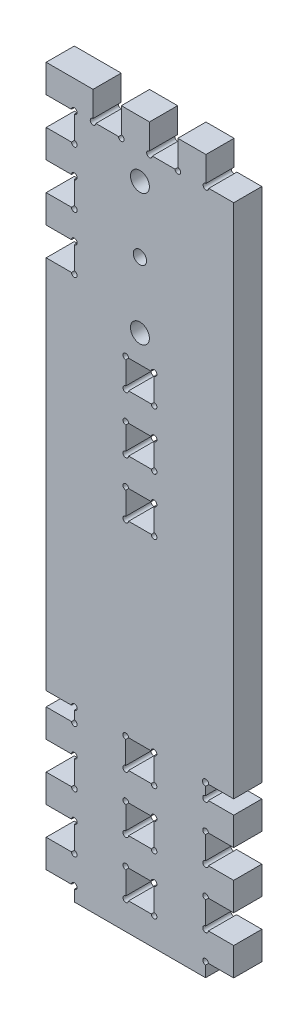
from build123d import *

# Parameters (mm, degrees)
AUFSATZ_LINEAR_AUSTRAGEN1_DEPTH = 15
SKIZZE3_R                       = 3.55
SCHNITT_LINEAR_AUSTRAGEN3_DEPTH = 17.5
SCHNITT_LINEAR_AUSTRAGEN5_DEPTH = 17.5
SKIZZE6_R                       = 5.05
SCHNITT_LINEAR_AUSTRAGEN6_DEPTH = 7.5


with BuildPart() as part:
    # Skizze1 → Aufsatz-Linear austragen1 (new body)
    with BuildSketch(Plane.XY):
        with BuildLine():
            Line((0, 82.6), (13.5, 82.6))
            ThreePointArc((13.5, 82.6), (16.060660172, 81.539339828), (15, 84.1))
            Line((15, 84.1), (15, 88.6))
            ThreePointArc((15, 88.6), (16.060660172, 91.160660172), (13.5, 90.1))
            Line((13.5, 90.1), (0, 90.1))
            Line((0, 90.1), (0, 289.970539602))
            Line((0, 289.970539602), (13.5, 289.970539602))
            ThreePointArc((13.5, 289.970539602), (16.060660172, 288.909879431), (15, 291.470539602))
            Line((15, 291.470539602), (15, 303.570539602))
            ThreePointArc((15, 303.570539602), (16.060660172, 306.131199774), (13.5, 305.070539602))
            Line((13.5, 305.070539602), (0, 305.070539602))
            Line((0, 305.070539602), (0, 320.070539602))
            Line((0, 320.070539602), (13.5, 320.070539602))
            ThreePointArc((13.5, 320.070539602), (16.060660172, 319.009879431), (15, 321.570539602))
            Line((15, 321.570539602), (15, 333.670539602))
            ThreePointArc((15, 333.670539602), (16.060660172, 336.231199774), (13.5, 335.170539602))
            Line((13.5, 335.170539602), (0, 335.170539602))
            Line((0, 335.170539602), (0, 350.170539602))
            Line((0, 350.170539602), (13.5, 350.170539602))
            ThreePointArc((13.5, 350.170539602), (16.060660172, 349.109879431), (15, 351.670539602))
            Line((15, 351.670539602), (15, 363.770539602))
            ThreePointArc((15, 363.770539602), (16.060660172, 366.331199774), (13.5, 365.270539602))
            Line((13.5, 365.270539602), (0, 365.270539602))
            Line((0, 365.270539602), (0, 380.270539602))
            Line((0, 380.270539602), (25, 380.270539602))
            Line((25, 380.270539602), (25, 366.770543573))
            ThreePointArc((25, 366.770543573), (23.939339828, 364.209883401), (26.5, 365.270543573))
            Line((26.5, 365.270543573), (38.6, 365.270543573))
            ThreePointArc((38.6, 365.270543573), (41.160660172, 364.209883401), (40.1, 366.770543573))
            Line((40.1, 366.770543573), (40.1, 380.270539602))
            Line((40.1, 380.270539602), (55.1, 380.270539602))
            Line((55.1, 380.270539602), (54.968914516, 366.764800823))
            ThreePointArc((54.968914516, 366.764800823), (54.086744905, 364.16450429), (56.6, 365.270539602))
            Line((56.6, 365.270539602), (68.7, 365.270539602))
            ThreePointArc((68.7, 365.270539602), (71.260660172, 364.209879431), (70.2, 366.770539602))
            Line((70.2, 366.770539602), (70.2, 380.270539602))
            Line((70.2, 380.270539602), (85.2, 380.270539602))
            Line((85.2, 380.270539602), (85.2, 366.9))
            ThreePointArc((85.2, 366.9), (84.139339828, 364.339339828), (86.7, 365.4))
            Line((86.7, 365.4), (100, 365.4))
            Line((100, 365.4), (100, 90.1))
            Line((100, 90.1), (86.7, 90.1))
            ThreePointArc((86.7, 90.1), (83.797918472, 91.302081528), (85, 88.4))
            Line((85, 88.4), (85, 84.1))
            ThreePointArc((85, 84.1), (83.939339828, 81.539339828), (86.5, 82.6))
            Line((86.5, 82.6), (100, 82.6))
            Line((100, 82.6), (100, 67.6))
            Line((100, 67.6), (86.5, 67.6))
            ThreePointArc((86.5, 67.6), (83.939339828, 68.660660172), (85, 66.1))
            Line((85, 66.1), (85, 54))
            ThreePointArc((85, 54), (83.939339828, 51.439339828), (86.5, 52.5))
            Line((86.5, 52.5), (100, 52.5))
            Line((100, 52.5), (100, 37.5))
            Line((100, 37.5), (86.5, 37.5))
            ThreePointArc((86.5, 37.5), (83.939339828, 38.560660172), (85, 36))
            Line((85, 36), (85, 23.9))
            ThreePointArc((85, 23.9), (83.939339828, 21.339339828), (86.5, 22.4))
            Line((86.5, 22.4), (100, 22.4))
            Line((100, 22.4), (100, 7.4))
            Line((100, 7.4), (86.5, 7.4))
            ThreePointArc((86.5, 7.4), (83.939339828, 8.460660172), (85, 5.9))
            Line((85, 5.9), (85, 0))
            Line((85, 0), (15, 0))
            Line((15, 0), (15, 5.9))
            ThreePointArc((15, 5.9), (16.060660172, 8.460660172), (13.5, 7.4))
            Line((13.5, 7.4), (0, 7.4))
            Line((0, 7.4), (0, 22.4))
            Line((0, 22.4), (13.5, 22.4))
            ThreePointArc((13.5, 22.4), (16.060660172, 21.339339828), (15, 23.9))
            Line((15, 23.9), (15, 36))
            ThreePointArc((15, 36), (16.060660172, 38.560660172), (13.5, 37.5))
            Line((13.5, 37.5), (0, 37.5))
            Line((0, 37.5), (0, 52.5))
            Line((0, 52.5), (13.5, 52.5))
            ThreePointArc((13.5, 52.5), (16.060660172, 51.439339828), (15, 54))
            Line((15, 54), (15, 66.1))
            ThreePointArc((15, 66.1), (16.060660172, 68.660660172), (13.5, 67.6))
            Line((13.5, 67.6), (0, 67.6))
            Line((0, 67.6), (0, 82.6))
        make_face()
    extrude(amount=AUFSATZ_LINEAR_AUSTRAGEN1_DEPTH)

    # Skizze3 → Schnitt-Linear austragen3 (cut)
    with BuildSketch(Plane(origin=(0, 0, 0), x_dir=(-1, 0, 0), z_dir=(0, 0, -1))):
        with Locations((-50, 315.270539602)):
            Circle(SKIZZE3_R)
    extrude(amount=-SCHNITT_LINEAR_AUSTRAGEN3_DEPTH, mode=Mode.SUBTRACT)

    # Skizze5 → Schnitt-Linear austragen5 (cut)
    with BuildSketch(Plane.XY.offset(15)):
        with BuildLine():
            ThreePointArc((56.05, 265.6), (58.610660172, 266.660660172), (57.55, 264.1))
            Line((57.55, 264.1), (57.55, 252))
            ThreePointArc((57.55, 252), (58.610660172, 249.439339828), (56.05, 250.5))
            Line((56.05, 250.5), (43.95, 250.5))
            ThreePointArc((43.95, 250.5), (41.389339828, 249.439339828), (42.45, 252))
            Line((42.45, 252), (42.45, 264.1))
            ThreePointArc((42.45, 264.1), (41.389339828, 266.660660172), (43.95, 265.6))
            Line((43.95, 265.6), (56.05, 265.6))
        make_face()
        with BuildLine():
            ThreePointArc((56.098323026, 235.5), (58.691331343, 236.478922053), (57.55, 233.953185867))
            Line((57.55, 233.953185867), (57.55, 221.9))
            ThreePointArc((57.55, 221.9), (58.610660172, 219.339339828), (56.05, 220.4))
            Line((56.05, 220.4), (43.95, 220.4))
            ThreePointArc((43.95, 220.4), (41.389339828, 219.339339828), (42.45, 221.9))
            Line((42.45, 221.9), (42.45, 234))
            ThreePointArc((42.45, 234), (41.389339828, 236.560660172), (43.95, 235.5))
            Line((43.95, 235.5), (56.098323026, 235.5))
        make_face()
        with BuildLine():
            Line((43.95, 190.3), (56.05, 190.3))
            ThreePointArc((56.05, 190.3), (58.610660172, 189.239339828), (57.55, 191.8))
            Line((57.55, 191.8), (57.55, 203.906112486))
            ThreePointArc((57.55, 203.906112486), (58.60023791, 206.471064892), (56.043912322, 205.4))
            Line((56.043912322, 205.4), (43.95, 205.4))
            ThreePointArc((43.95, 205.4), (41.389339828, 206.460660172), (42.45, 203.9))
            Line((42.45, 203.9), (42.45, 191.8))
            ThreePointArc((42.45, 191.8), (41.389339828, 189.239339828), (43.95, 190.3))
        make_face()
        with BuildLine():
            ThreePointArc((42.407764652, 88.8), (41.34710448, 91.360660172), (43.907764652, 90.3))
            Line((43.907764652, 90.3), (56.007764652, 90.3))
            ThreePointArc((56.007764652, 90.3), (58.568424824, 91.360660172), (57.507764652, 88.8))
            Line((57.507764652, 88.8), (57.507764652, 76.7))
            ThreePointArc((57.507764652, 76.7), (58.568424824, 74.139339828), (56.007764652, 75.2))
            Line((56.007764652, 75.2), (43.907764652, 75.2))
            ThreePointArc((43.907764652, 75.2), (41.34710448, 74.139339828), (42.407764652, 76.7))
            Line((42.407764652, 76.7), (42.407764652, 88.8))
        make_face()
        with BuildLine():
            ThreePointArc((43.956087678, 45.1), (41.395427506, 44.039339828), (42.456087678, 46.6))
            Line((42.456087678, 46.6), (42.456087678, 58.7))
            ThreePointArc((42.456087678, 58.7), (41.395427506, 61.260660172), (43.956087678, 60.2))
            Line((43.956087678, 60.2), (56.056087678, 60.2))
            ThreePointArc((56.056087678, 60.2), (58.61674785, 61.260660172), (57.556087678, 58.7))
            Line((57.556087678, 58.7), (57.556087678, 46.6))
            ThreePointArc((57.556087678, 46.6), (58.61674785, 44.039339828), (56.056087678, 45.1))
            Line((56.056087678, 45.1), (43.956087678, 45.1))
        make_face()
        with BuildLine():
            ThreePointArc((56.05, 30.1), (58.610660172, 31.160660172), (57.55, 28.6))
            Line((57.55, 28.6), (57.55, 16.5))
            ThreePointArc((57.55, 16.5), (58.610660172, 13.939339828), (56.05, 15))
            Line((56.05, 15), (43.95, 15))
            ThreePointArc((43.95, 15), (41.389339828, 13.939339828), (42.45, 16.5))
            Line((42.45, 16.5), (42.45, 28.6))
            ThreePointArc((42.45, 28.6), (41.389339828, 31.160660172), (43.95, 30.1))
            Line((43.95, 30.1), (56.05, 30.1))
        make_face()
    extrude(amount=-SCHNITT_LINEAR_AUSTRAGEN5_DEPTH, mode=Mode.SUBTRACT)

    # Skizze6 → Schnitt-Linear austragen6 (cut)
    with BuildSketch(Plane.XY.offset(15)):
        with Locations((50, 350.270539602)):
            Circle(SKIZZE6_R)
        with Locations((50, 280.270539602)):
            Circle(SKIZZE6_R)
    extrude(amount=-SCHNITT_LINEAR_AUSTRAGEN6_DEPTH, mode=Mode.SUBTRACT)


solid = part.part
